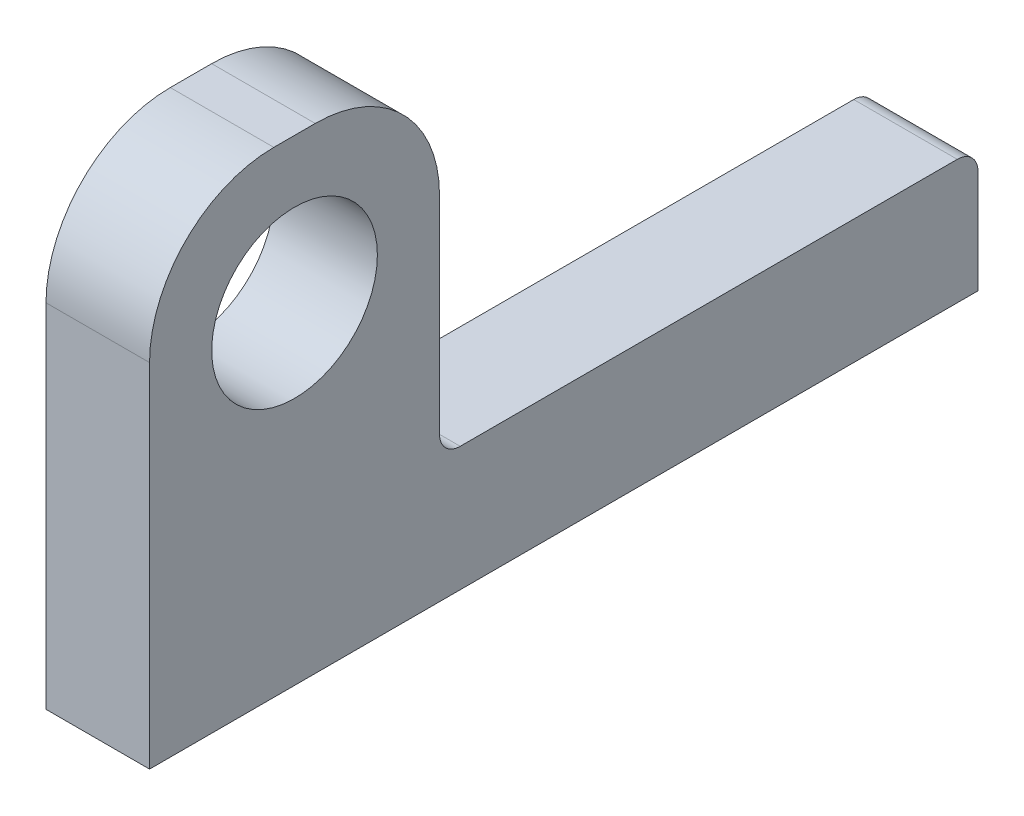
from build123d import *

# Parameters (mm, degrees)
SKETCH1_R           = 4
BOSS_EXTRUDE1_DEPTH = 5
FILLET1_R           = 1


with BuildPart() as part:
    # Sketch1 → Boss-Extrude1 (new body)
    with BuildSketch(Plane(origin=(0, 0, 0), x_dir=(0, 0, -1), z_dir=(1, 0, 0))):
        with BuildLine():
            Line((0, 0), (40, 0))
            Line((40, 0), (40, 6))
            Line((40, 6), (14, 6))
            Line((14, 6), (14, 17))
            ThreePointArc((14, 17), (12.242640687, 21.242640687), (8, 23))
            Line((8, 23), (6, 23))
            ThreePointArc((6, 23), (1.757359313, 21.242640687), (0, 17))
            Line((0, 17), (0, 6))
            Line((0, 6), (0, 0))
        make_face()
        with Locations((7, 16)):
            Circle(SKETCH1_R, mode=Mode.SUBTRACT)
    extrude(amount=BOSS_EXTRUDE1_DEPTH)

    # Fillet1
    fillet1_edges = [part.edges().sort_by_distance(p)[0] for p in [
        (2.5, 6, -14),
        (2.5, 6, -40),
    ]]
    fillet(fillet1_edges, radius=FILLET1_R)


solid = part.part
